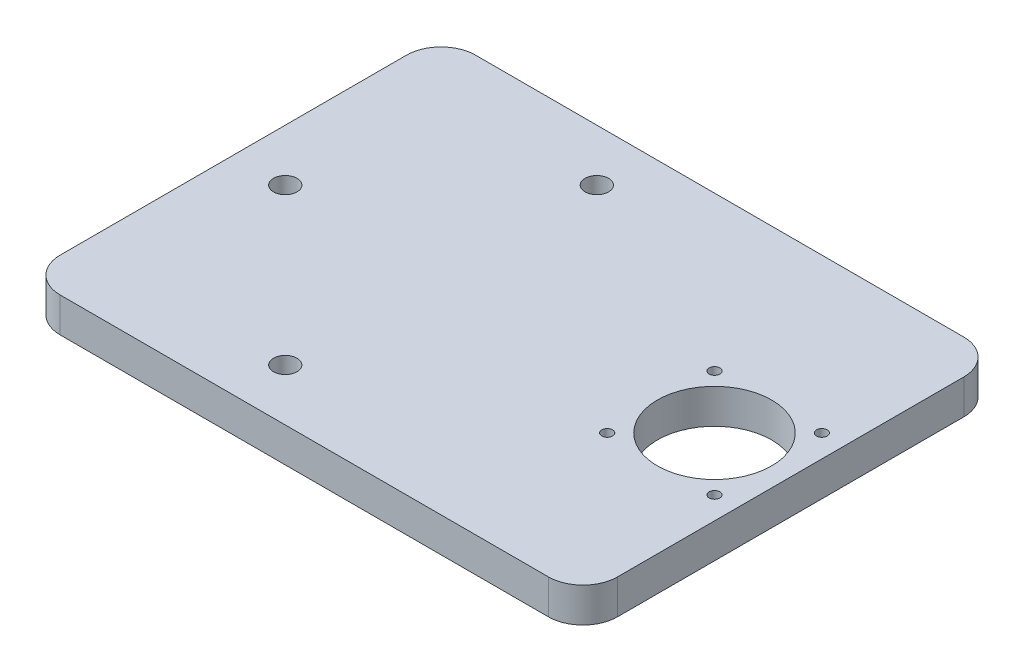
ISO-10303-21;
HEADER;
FILE_DESCRIPTION(('STEP AP214'),'2;1');
FILE_NAME('part.step','',(''),(''),'','','');
FILE_SCHEMA(('AUTOMOTIVE_DESIGN { 1 0 10303 214 1 1 1 1 }'));
ENDSEC;
DATA;
#1=APPLICATION_CONTEXT('core data for automotive mechanical design processes');
#2=APPLICATION_PROTOCOL_DEFINITION('international standard','automotive_design',2000,#1);
#3=PRODUCT_CONTEXT('',#1,'mechanical');
#4=PRODUCT('Part','Part','',(#3));
#5=PRODUCT_RELATED_PRODUCT_CATEGORY('part','',(#4));
#6=PRODUCT_DEFINITION_FORMATION('','',#4);
#7=PRODUCT_DEFINITION_CONTEXT('part definition',#1,'design');
#8=PRODUCT_DEFINITION('design','',#6,#7);
#9=PRODUCT_DEFINITION_SHAPE('','',#8);
#10=(LENGTH_UNIT() NAMED_UNIT(*) SI_UNIT(.MILLI.,.METRE.));
#11=(NAMED_UNIT(*) PLANE_ANGLE_UNIT() SI_UNIT($,.RADIAN.));
#12=(NAMED_UNIT(*) SI_UNIT($,.STERADIAN.) SOLID_ANGLE_UNIT());
#13=UNCERTAINTY_MEASURE_WITH_UNIT(LENGTH_MEASURE(1.E-05),#10,'distance_accuracy_value','');
#14=(GEOMETRIC_REPRESENTATION_CONTEXT(3) GLOBAL_UNCERTAINTY_ASSIGNED_CONTEXT((#13)) GLOBAL_UNIT_ASSIGNED_CONTEXT((#10,
#11,#12)) REPRESENTATION_CONTEXT('',''));
#15=CARTESIAN_POINT('',(0.,0.,0.));
#16=DIRECTION('',(0.,0.,1.));
#17=DIRECTION('',(1.,0.,0.));
#18=AXIS2_PLACEMENT_3D('',#15,#16,#17);
#19=CARTESIAN_POINT('',(80.5,10.,60.));
#20=DIRECTION('',(-1.,0.,0.));
#21=DIRECTION('',(0.,0.,1.));
#22=AXIS2_PLACEMENT_3D('',#19,#20,#21);
#23=PLANE('',#22);
#24=DIRECTION('',(0.,0.,-1.));
#25=VECTOR('',#24,1.);
#26=CARTESIAN_POINT('',(80.5,10.,60.));
#27=LINE('',#26,#25);
#28=CARTESIAN_POINT('',(80.5,10.,50.));
#29=VERTEX_POINT('',#28);
#30=CARTESIAN_POINT('',(80.5,10.,-50.));
#31=VERTEX_POINT('',#30);
#32=EDGE_CURVE('E130',#29,#31,#27,.T.);
#33=ORIENTED_EDGE('',*,*,#32,.F.);
#34=DIRECTION('',(0.,-1.,0.));
#35=VECTOR('',#34,1.);
#36=CARTESIAN_POINT('',(80.5,10.,50.));
#37=LINE('',#36,#35);
#38=CARTESIAN_POINT('',(80.5,0.,50.));
#39=VERTEX_POINT('',#38);
#40=EDGE_CURVE('E113',#29,#39,#37,.T.);
#41=ORIENTED_EDGE('',*,*,#40,.T.);
#42=DIRECTION('',(0.,0.,-1.));
#43=VECTOR('',#42,1.);
#44=CARTESIAN_POINT('',(80.5,0.,60.));
#45=LINE('',#44,#43);
#46=CARTESIAN_POINT('',(80.5,0.,-50.));
#47=VERTEX_POINT('',#46);
#48=EDGE_CURVE('E123',#39,#47,#45,.T.);
#49=ORIENTED_EDGE('',*,*,#48,.T.);
#50=DIRECTION('',(0.,-1.,0.));
#51=VECTOR('',#50,1.);
#52=CARTESIAN_POINT('',(80.5,10.,-50.));
#53=LINE('',#52,#51);
#54=EDGE_CURVE('E127',#47,#31,#53,.F.);
#55=ORIENTED_EDGE('',*,*,#54,.T.);
#56=EDGE_LOOP('',(#33,#41,#49,#55));
#57=FACE_BOUND('',#56,.T.);
#58=ADVANCED_FACE('F43',(#57),#23,.F.);
#59=CARTESIAN_POINT('',(-80.5,10.,-60.));
#60=DIRECTION('',(0.,0.,1.));
#61=DIRECTION('',(1.,0.,0.));
#62=AXIS2_PLACEMENT_3D('',#59,#60,#61);
#63=PLANE('',#62);
#64=DIRECTION('',(-1.,0.,0.));
#65=VECTOR('',#64,1.);
#66=CARTESIAN_POINT('',(-80.5,10.,-60.));
#67=LINE('',#66,#65);
#68=CARTESIAN_POINT('',(70.5,10.,-60.));
#69=VERTEX_POINT('',#68);
#70=CARTESIAN_POINT('',(-70.5,10.,-60.));
#71=VERTEX_POINT('',#70);
#72=EDGE_CURVE('E172',#69,#71,#67,.T.);
#73=ORIENTED_EDGE('',*,*,#72,.F.);
#74=DIRECTION('',(0.,-1.,0.));
#75=VECTOR('',#74,1.);
#76=CARTESIAN_POINT('',(70.5,10.,-60.));
#77=LINE('',#76,#75);
#78=CARTESIAN_POINT('',(70.5,0.,-60.));
#79=VERTEX_POINT('',#78);
#80=EDGE_CURVE('E170',#69,#79,#77,.T.);
#81=ORIENTED_EDGE('',*,*,#80,.T.);
#82=DIRECTION('',(-1.,0.,0.));
#83=VECTOR('',#82,1.);
#84=CARTESIAN_POINT('',(-80.5,0.,-60.));
#85=LINE('',#84,#83);
#86=CARTESIAN_POINT('',(-70.5,0.,-60.));
#87=VERTEX_POINT('',#86);
#88=EDGE_CURVE('E131',#79,#87,#85,.T.);
#89=ORIENTED_EDGE('',*,*,#88,.T.);
#90=DIRECTION('',(0.,-1.,0.));
#91=VECTOR('',#90,1.);
#92=CARTESIAN_POINT('',(-70.5,10.,-60.));
#93=LINE('',#92,#91);
#94=EDGE_CURVE('E164',#87,#71,#93,.F.);
#95=ORIENTED_EDGE('',*,*,#94,.T.);
#96=EDGE_LOOP('',(#73,#81,#89,#95));
#97=FACE_BOUND('',#96,.T.);
#98=ADVANCED_FACE('F175',(#97),#63,.F.);
#99=CARTESIAN_POINT('',(-80.5,10.,60.));
#100=DIRECTION('',(1.,0.,0.));
#101=DIRECTION('',(0.,0.,-1.));
#102=AXIS2_PLACEMENT_3D('',#99,#100,#101);
#103=PLANE('',#102);
#104=DIRECTION('',(0.,0.,1.));
#105=VECTOR('',#104,1.);
#106=CARTESIAN_POINT('',(-80.5,10.,60.));
#107=LINE('',#106,#105);
#108=CARTESIAN_POINT('',(-80.5,10.,-50.));
#109=VERTEX_POINT('',#108);
#110=CARTESIAN_POINT('',(-80.5,10.,50.));
#111=VERTEX_POINT('',#110);
#112=EDGE_CURVE('E185',#109,#111,#107,.T.);
#113=ORIENTED_EDGE('',*,*,#112,.F.);
#114=DIRECTION('',(0.,-1.,0.));
#115=VECTOR('',#114,1.);
#116=CARTESIAN_POINT('',(-80.5,10.,-50.));
#117=LINE('',#116,#115);
#118=CARTESIAN_POINT('',(-80.5,0.,-50.));
#119=VERTEX_POINT('',#118);
#120=EDGE_CURVE('E11',#109,#119,#117,.T.);
#121=ORIENTED_EDGE('',*,*,#120,.T.);
#122=DIRECTION('',(0.,0.,1.));
#123=VECTOR('',#122,1.);
#124=CARTESIAN_POINT('',(-80.5,0.,60.));
#125=LINE('',#124,#123);
#126=CARTESIAN_POINT('',(-80.5,0.,50.));
#127=VERTEX_POINT('',#126);
#128=EDGE_CURVE('E137',#119,#127,#125,.T.);
#129=ORIENTED_EDGE('',*,*,#128,.T.);
#130=DIRECTION('',(0.,-1.,0.));
#131=VECTOR('',#130,1.);
#132=CARTESIAN_POINT('',(-80.5,10.,50.));
#133=LINE('',#132,#131);
#134=EDGE_CURVE('E51',#127,#111,#133,.F.);
#135=ORIENTED_EDGE('',*,*,#134,.T.);
#136=EDGE_LOOP('',(#113,#121,#129,#135));
#137=FACE_BOUND('',#136,.T.);
#138=ADVANCED_FACE('F181',(#137),#103,.F.);
#139=CARTESIAN_POINT('',(-80.5,10.,60.));
#140=DIRECTION('',(0.,0.,-1.));
#141=DIRECTION('',(-1.,0.,0.));
#142=AXIS2_PLACEMENT_3D('',#139,#140,#141);
#143=PLANE('',#142);
#144=DIRECTION('',(1.,0.,0.));
#145=VECTOR('',#144,1.);
#146=CARTESIAN_POINT('',(-80.5,0.,60.));
#147=LINE('',#146,#145);
#148=CARTESIAN_POINT('',(-70.5,0.,60.));
#149=VERTEX_POINT('',#148);
#150=CARTESIAN_POINT('',(70.5,0.,60.));
#151=VERTEX_POINT('',#150);
#152=EDGE_CURVE('E150',#149,#151,#147,.T.);
#153=ORIENTED_EDGE('',*,*,#152,.T.);
#154=DIRECTION('',(0.,-1.,0.));
#155=VECTOR('',#154,1.);
#156=CARTESIAN_POINT('',(70.5,10.,60.));
#157=LINE('',#156,#155);
#158=CARTESIAN_POINT('',(70.5,10.,60.));
#159=VERTEX_POINT('',#158);
#160=EDGE_CURVE('E112',#151,#159,#157,.F.);
#161=ORIENTED_EDGE('',*,*,#160,.T.);
#162=DIRECTION('',(1.,0.,0.));
#163=VECTOR('',#162,1.);
#164=CARTESIAN_POINT('',(-80.5,10.,60.));
#165=LINE('',#164,#163);
#166=CARTESIAN_POINT('',(-70.5,10.,60.));
#167=VERTEX_POINT('',#166);
#168=EDGE_CURVE('E144',#167,#159,#165,.T.);
#169=ORIENTED_EDGE('',*,*,#168,.F.);
#170=DIRECTION('',(0.,-1.,0.));
#171=VECTOR('',#170,1.);
#172=CARTESIAN_POINT('',(-70.5,10.,60.));
#173=LINE('',#172,#171);
#174=EDGE_CURVE('E118',#167,#149,#173,.T.);
#175=ORIENTED_EDGE('',*,*,#174,.T.);
#176=EDGE_LOOP('',(#153,#161,#169,#175));
#177=FACE_BOUND('',#176,.T.);
#178=ADVANCED_FACE('F267',(#177),#143,.F.);
#179=CARTESIAN_POINT('',(0.,10.,0.));
#180=DIRECTION('',(0.,-1.,0.));
#181=DIRECTION('',(0.,0.,-1.));
#182=AXIS2_PLACEMENT_3D('',#179,#180,#181);
#183=PLANE('',#182);
#184=CARTESIAN_POINT('',(-20.4999999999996,10.,45.));
#185=DIRECTION('',(0.,-1.,0.));
#186=DIRECTION('',(0.,0.,-1.));
#187=AXIS2_PLACEMENT_3D('',#184,#185,#186);
#188=CIRCLE('',#187,3.4);
#189=CARTESIAN_POINT('',(-20.4999999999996,10.,41.6));
#190=VERTEX_POINT('',#189);
#191=EDGE_CURVE('E211',#190,#190,#188,.T.);
#192=ORIENTED_EDGE('',*,*,#191,.T.);
#193=EDGE_LOOP('',(#192));
#194=FACE_BOUND('',#193,.T.);
#195=CARTESIAN_POINT('',(-65.5,10.,3.51845289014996E-12));
#196=DIRECTION('',(0.,-1.,0.));
#197=DIRECTION('',(0.,0.,-1.));
#198=AXIS2_PLACEMENT_3D('',#195,#196,#197);
#199=CIRCLE('',#198,3.4);
#200=CARTESIAN_POINT('',(-65.5,10.,-3.39999999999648));
#201=VERTEX_POINT('',#200);
#202=EDGE_CURVE('E221',#201,#201,#199,.T.);
#203=ORIENTED_EDGE('',*,*,#202,.T.);
#204=EDGE_LOOP('',(#203));
#205=FACE_BOUND('',#204,.T.);
#206=CARTESIAN_POINT('',(-20.4999999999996,10.,-45.));
#207=DIRECTION('',(0.,-1.,0.));
#208=DIRECTION('',(0.,0.,-1.));
#209=AXIS2_PLACEMENT_3D('',#206,#207,#208);
#210=CIRCLE('',#209,3.4);
#211=CARTESIAN_POINT('',(-20.4999999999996,10.,-48.4));
#212=VERTEX_POINT('',#211);
#213=EDGE_CURVE('E212',#212,#212,#210,.T.);
#214=ORIENTED_EDGE('',*,*,#213,.T.);
#215=EDGE_LOOP('',(#214));
#216=FACE_BOUND('',#215,.T.);
#217=CARTESIAN_POINT('',(58.5000000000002,10.,2.72676846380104E-12));
#218=DIRECTION('',(0.,-1.,0.));
#219=DIRECTION('',(0.,0.,-1.));
#220=AXIS2_PLACEMENT_3D('',#217,#218,#219);
#221=CIRCLE('',#220,16.5);
#222=CARTESIAN_POINT('',(58.5000000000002,10.,-16.4999999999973));
#223=VERTEX_POINT('',#222);
#224=EDGE_CURVE('E207',#223,#223,#221,.T.);
#225=ORIENTED_EDGE('',*,*,#224,.T.);
#226=EDGE_LOOP('',(#225));
#227=FACE_BOUND('',#226,.T.);
#228=CARTESIAN_POINT('',(74.0000000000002,10.,15.5000000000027));
#229=DIRECTION('',(0.,1.,0.));
#230=DIRECTION('',(0.,0.,1.));
#231=AXIS2_PLACEMENT_3D('',#228,#229,#230);
#232=CIRCLE('',#231,1.54999999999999);
#233=CARTESIAN_POINT('',(74.0000000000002,10.,17.0500000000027));
#234=VERTEX_POINT('',#233);
#235=EDGE_CURVE('E186',#234,#234,#232,.T.);
#236=ORIENTED_EDGE('',*,*,#235,.F.);
#237=EDGE_LOOP('',(#236));
#238=FACE_BOUND('',#237,.T.);
#239=CARTESIAN_POINT('',(43.0000000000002,10.,-15.4999999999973));
#240=DIRECTION('',(0.,1.,0.));
#241=DIRECTION('',(0.,0.,1.));
#242=AXIS2_PLACEMENT_3D('',#239,#240,#241);
#243=CIRCLE('',#242,1.55);
#244=CARTESIAN_POINT('',(43.0000000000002,10.,-13.9499999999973));
#245=VERTEX_POINT('',#244);
#246=EDGE_CURVE('E193',#245,#245,#243,.T.);
#247=ORIENTED_EDGE('',*,*,#246,.F.);
#248=EDGE_LOOP('',(#247));
#249=FACE_BOUND('',#248,.T.);
#250=CARTESIAN_POINT('',(43.0000000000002,10.,15.5000000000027));
#251=DIRECTION('',(0.,1.,0.));
#252=DIRECTION('',(0.,0.,1.));
#253=AXIS2_PLACEMENT_3D('',#250,#251,#252);
#254=CIRCLE('',#253,1.55);
#255=CARTESIAN_POINT('',(43.0000000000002,10.,17.0500000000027));
#256=VERTEX_POINT('',#255);
#257=EDGE_CURVE('E192',#256,#256,#254,.T.);
#258=ORIENTED_EDGE('',*,*,#257,.F.);
#259=EDGE_LOOP('',(#258));
#260=FACE_BOUND('',#259,.T.);
#261=CARTESIAN_POINT('',(74.0000000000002,10.,-15.4999999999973));
#262=DIRECTION('',(0.,1.,0.));
#263=DIRECTION('',(0.,0.,1.));
#264=AXIS2_PLACEMENT_3D('',#261,#262,#263);
#265=CIRCLE('',#264,1.54999999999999);
#266=CARTESIAN_POINT('',(74.0000000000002,10.,-13.9499999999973));
#267=VERTEX_POINT('',#266);
#268=EDGE_CURVE('E142',#267,#267,#265,.T.);
#269=ORIENTED_EDGE('',*,*,#268,.F.);
#270=EDGE_LOOP('',(#269));
#271=FACE_BOUND('',#270,.T.);
#272=ORIENTED_EDGE('',*,*,#168,.T.);
#273=CARTESIAN_POINT('',(70.5,10.,50.));
#274=DIRECTION('',(0.,-1.,0.));
#275=DIRECTION('',(0.,0.,-1.));
#276=AXIS2_PLACEMENT_3D('',#273,#274,#275);
#277=CIRCLE('',#276,10.);
#278=EDGE_CURVE('E161',#159,#29,#277,.F.);
#279=ORIENTED_EDGE('',*,*,#278,.T.);
#280=ORIENTED_EDGE('',*,*,#32,.T.);
#281=CARTESIAN_POINT('',(70.5,10.,-50.));
#282=DIRECTION('',(0.,-1.,0.));
#283=DIRECTION('',(0.,0.,-1.));
#284=AXIS2_PLACEMENT_3D('',#281,#282,#283);
#285=CIRCLE('',#284,10.);
#286=EDGE_CURVE('E163',#31,#69,#285,.F.);
#287=ORIENTED_EDGE('',*,*,#286,.T.);
#288=ORIENTED_EDGE('',*,*,#72,.T.);
#289=CARTESIAN_POINT('',(-70.5,10.,-50.));
#290=DIRECTION('',(0.,-1.,0.));
#291=DIRECTION('',(0.,0.,-1.));
#292=AXIS2_PLACEMENT_3D('',#289,#290,#291);
#293=CIRCLE('',#292,10.);
#294=EDGE_CURVE('E63',#71,#109,#293,.F.);
#295=ORIENTED_EDGE('',*,*,#294,.T.);
#296=ORIENTED_EDGE('',*,*,#112,.T.);
#297=CARTESIAN_POINT('',(-70.5,10.,50.));
#298=DIRECTION('',(0.,-1.,0.));
#299=DIRECTION('',(0.,0.,-1.));
#300=AXIS2_PLACEMENT_3D('',#297,#298,#299);
#301=CIRCLE('',#300,10.);
#302=EDGE_CURVE('E157',#111,#167,#301,.F.);
#303=ORIENTED_EDGE('',*,*,#302,.T.);
#304=EDGE_LOOP('',(#272,#279,#280,#287,#288,#295,#296,#303));
#305=FACE_BOUND('',#304,.T.);
#306=ADVANCED_FACE('F231',(#194,#205,#216,#227,#238,#249,#260,#271,#305),#183,.F.);
#307=CARTESIAN_POINT('',(0.,0.,0.));
#308=DIRECTION('',(0.,-1.,0.));
#309=DIRECTION('',(0.,0.,-1.));
#310=AXIS2_PLACEMENT_3D('',#307,#308,#309);
#311=PLANE('',#310);
#312=CARTESIAN_POINT('',(-20.4999999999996,0.,45.));
#313=DIRECTION('',(0.,-1.,0.));
#314=DIRECTION('',(0.,0.,-1.));
#315=AXIS2_PLACEMENT_3D('',#312,#313,#314);
#316=CIRCLE('',#315,3.4);
#317=CARTESIAN_POINT('',(-20.4999999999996,0.,41.6));
#318=VERTEX_POINT('',#317);
#319=EDGE_CURVE('E227',#318,#318,#316,.T.);
#320=ORIENTED_EDGE('',*,*,#319,.F.);
#321=EDGE_LOOP('',(#320));
#322=FACE_BOUND('',#321,.T.);
#323=CARTESIAN_POINT('',(-65.5,0.,3.51845289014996E-12));
#324=DIRECTION('',(0.,-1.,0.));
#325=DIRECTION('',(0.,0.,-1.));
#326=AXIS2_PLACEMENT_3D('',#323,#324,#325);
#327=CIRCLE('',#326,3.4);
#328=CARTESIAN_POINT('',(-65.5,0.,-3.39999999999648));
#329=VERTEX_POINT('',#328);
#330=EDGE_CURVE('E223',#329,#329,#327,.T.);
#331=ORIENTED_EDGE('',*,*,#330,.F.);
#332=EDGE_LOOP('',(#331));
#333=FACE_BOUND('',#332,.T.);
#334=CARTESIAN_POINT('',(-20.4999999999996,0.,-45.));
#335=DIRECTION('',(0.,-1.,0.));
#336=DIRECTION('',(0.,0.,-1.));
#337=AXIS2_PLACEMENT_3D('',#334,#335,#336);
#338=CIRCLE('',#337,3.4);
#339=CARTESIAN_POINT('',(-20.4999999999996,0.,-48.4));
#340=VERTEX_POINT('',#339);
#341=EDGE_CURVE('E220',#340,#340,#338,.T.);
#342=ORIENTED_EDGE('',*,*,#341,.F.);
#343=EDGE_LOOP('',(#342));
#344=FACE_BOUND('',#343,.T.);
#345=CARTESIAN_POINT('',(58.5000000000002,0.,2.72676846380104E-12));
#346=DIRECTION('',(0.,-1.,0.));
#347=DIRECTION('',(0.,0.,-1.));
#348=AXIS2_PLACEMENT_3D('',#345,#346,#347);
#349=CIRCLE('',#348,16.5);
#350=CARTESIAN_POINT('',(58.5000000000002,0.,-16.4999999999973));
#351=VERTEX_POINT('',#350);
#352=EDGE_CURVE('E209',#351,#351,#349,.T.);
#353=ORIENTED_EDGE('',*,*,#352,.F.);
#354=EDGE_LOOP('',(#353));
#355=FACE_BOUND('',#354,.T.);
#356=CARTESIAN_POINT('',(74.0000000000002,0.,15.5000000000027));
#357=DIRECTION('',(0.,1.,0.));
#358=DIRECTION('',(0.,0.,1.));
#359=AXIS2_PLACEMENT_3D('',#356,#357,#358);
#360=CIRCLE('',#359,1.54999999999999);
#361=CARTESIAN_POINT('',(74.0000000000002,0.,17.0500000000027));
#362=VERTEX_POINT('',#361);
#363=EDGE_CURVE('E200',#362,#362,#360,.T.);
#364=ORIENTED_EDGE('',*,*,#363,.T.);
#365=EDGE_LOOP('',(#364));
#366=FACE_BOUND('',#365,.T.);
#367=CARTESIAN_POINT('',(43.0000000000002,0.,-15.4999999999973));
#368=DIRECTION('',(0.,1.,0.));
#369=DIRECTION('',(0.,0.,1.));
#370=AXIS2_PLACEMENT_3D('',#367,#368,#369);
#371=CIRCLE('',#370,1.55);
#372=CARTESIAN_POINT('',(43.0000000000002,0.,-13.9499999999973));
#373=VERTEX_POINT('',#372);
#374=EDGE_CURVE('E194',#373,#373,#371,.T.);
#375=ORIENTED_EDGE('',*,*,#374,.T.);
#376=EDGE_LOOP('',(#375));
#377=FACE_BOUND('',#376,.T.);
#378=CARTESIAN_POINT('',(43.0000000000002,0.,15.5000000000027));
#379=DIRECTION('',(0.,1.,0.));
#380=DIRECTION('',(0.,0.,1.));
#381=AXIS2_PLACEMENT_3D('',#378,#379,#380);
#382=CIRCLE('',#381,1.55);
#383=CARTESIAN_POINT('',(43.0000000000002,0.,17.0500000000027));
#384=VERTEX_POINT('',#383);
#385=EDGE_CURVE('E202',#384,#384,#382,.T.);
#386=ORIENTED_EDGE('',*,*,#385,.T.);
#387=EDGE_LOOP('',(#386));
#388=FACE_BOUND('',#387,.T.);
#389=CARTESIAN_POINT('',(74.0000000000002,0.,-15.4999999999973));
#390=DIRECTION('',(0.,1.,0.));
#391=DIRECTION('',(0.,0.,1.));
#392=AXIS2_PLACEMENT_3D('',#389,#390,#391);
#393=CIRCLE('',#392,1.54999999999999);
#394=CARTESIAN_POINT('',(74.0000000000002,0.,-13.9499999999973));
#395=VERTEX_POINT('',#394);
#396=EDGE_CURVE('E133',#395,#395,#393,.T.);
#397=ORIENTED_EDGE('',*,*,#396,.T.);
#398=EDGE_LOOP('',(#397));
#399=FACE_BOUND('',#398,.T.);
#400=ORIENTED_EDGE('',*,*,#48,.F.);
#401=CARTESIAN_POINT('',(70.5,0.,50.));
#402=DIRECTION('',(0.,-1.,0.));
#403=DIRECTION('',(0.,0.,-1.));
#404=AXIS2_PLACEMENT_3D('',#401,#402,#403);
#405=CIRCLE('',#404,10.);
#406=EDGE_CURVE('E107',#39,#151,#405,.T.);
#407=ORIENTED_EDGE('',*,*,#406,.T.);
#408=ORIENTED_EDGE('',*,*,#152,.F.);
#409=CARTESIAN_POINT('',(-70.5,0.,50.));
#410=DIRECTION('',(0.,-1.,0.));
#411=DIRECTION('',(0.,0.,-1.));
#412=AXIS2_PLACEMENT_3D('',#409,#410,#411);
#413=CIRCLE('',#412,10.);
#414=EDGE_CURVE('E128',#149,#127,#413,.T.);
#415=ORIENTED_EDGE('',*,*,#414,.T.);
#416=ORIENTED_EDGE('',*,*,#128,.F.);
#417=CARTESIAN_POINT('',(-70.5,0.,-50.));
#418=DIRECTION('',(0.,-1.,0.));
#419=DIRECTION('',(0.,0.,-1.));
#420=AXIS2_PLACEMENT_3D('',#417,#418,#419);
#421=CIRCLE('',#420,10.);
#422=EDGE_CURVE('E154',#119,#87,#421,.T.);
#423=ORIENTED_EDGE('',*,*,#422,.T.);
#424=ORIENTED_EDGE('',*,*,#88,.F.);
#425=CARTESIAN_POINT('',(70.5,0.,-50.));
#426=DIRECTION('',(0.,-1.,0.));
#427=DIRECTION('',(0.,0.,-1.));
#428=AXIS2_PLACEMENT_3D('',#425,#426,#427);
#429=CIRCLE('',#428,10.);
#430=EDGE_CURVE('E119',#79,#47,#429,.T.);
#431=ORIENTED_EDGE('',*,*,#430,.T.);
#432=EDGE_LOOP('',(#400,#407,#408,#415,#416,#423,#424,#431));
#433=FACE_BOUND('',#432,.T.);
#434=ADVANCED_FACE('F134',(#322,#333,#344,#355,#366,#377,#388,#399,#433),#311,.T.);
#435=CARTESIAN_POINT('',(70.5,10.,50.));
#436=DIRECTION('',(0.,-1.,0.));
#437=DIRECTION('',(0.,0.,-1.));
#438=AXIS2_PLACEMENT_3D('',#435,#436,#437);
#439=CYLINDRICAL_SURFACE('',#438,10.);
#440=ORIENTED_EDGE('',*,*,#278,.F.);
#441=ORIENTED_EDGE('',*,*,#160,.F.);
#442=ORIENTED_EDGE('',*,*,#406,.F.);
#443=ORIENTED_EDGE('',*,*,#40,.F.);
#444=EDGE_LOOP('',(#440,#441,#442,#443));
#445=FACE_BOUND('',#444,.T.);
#446=ADVANCED_FACE('F115',(#445),#439,.T.);
#447=CARTESIAN_POINT('',(70.5,10.,-50.));
#448=DIRECTION('',(0.,-1.,0.));
#449=DIRECTION('',(0.,0.,-1.));
#450=AXIS2_PLACEMENT_3D('',#447,#448,#449);
#451=CYLINDRICAL_SURFACE('',#450,10.);
#452=ORIENTED_EDGE('',*,*,#286,.F.);
#453=ORIENTED_EDGE('',*,*,#54,.F.);
#454=ORIENTED_EDGE('',*,*,#430,.F.);
#455=ORIENTED_EDGE('',*,*,#80,.F.);
#456=EDGE_LOOP('',(#452,#453,#454,#455));
#457=FACE_BOUND('',#456,.T.);
#458=ADVANCED_FACE('F280',(#457),#451,.T.);
#459=CARTESIAN_POINT('',(-70.5,10.,-50.));
#460=DIRECTION('',(0.,-1.,0.));
#461=DIRECTION('',(0.,0.,-1.));
#462=AXIS2_PLACEMENT_3D('',#459,#460,#461);
#463=CYLINDRICAL_SURFACE('',#462,10.);
#464=ORIENTED_EDGE('',*,*,#294,.F.);
#465=ORIENTED_EDGE('',*,*,#94,.F.);
#466=ORIENTED_EDGE('',*,*,#422,.F.);
#467=ORIENTED_EDGE('',*,*,#120,.F.);
#468=EDGE_LOOP('',(#464,#465,#466,#467));
#469=FACE_BOUND('',#468,.T.);
#470=ADVANCED_FACE('F179',(#469),#463,.T.);
#471=CARTESIAN_POINT('',(-70.5,10.,50.));
#472=DIRECTION('',(0.,-1.,0.));
#473=DIRECTION('',(0.,0.,-1.));
#474=AXIS2_PLACEMENT_3D('',#471,#472,#473);
#475=CYLINDRICAL_SURFACE('',#474,10.);
#476=ORIENTED_EDGE('',*,*,#302,.F.);
#477=ORIENTED_EDGE('',*,*,#134,.F.);
#478=ORIENTED_EDGE('',*,*,#414,.F.);
#479=ORIENTED_EDGE('',*,*,#174,.F.);
#480=EDGE_LOOP('',(#476,#477,#478,#479));
#481=FACE_BOUND('',#480,.T.);
#482=ADVANCED_FACE('F44',(#481),#475,.T.);
#483=CARTESIAN_POINT('',(74.0000000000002,0.,-15.4999999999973));
#484=DIRECTION('',(0.,1.,0.));
#485=DIRECTION('',(0.,0.,1.));
#486=AXIS2_PLACEMENT_3D('',#483,#484,#485);
#487=CYLINDRICAL_SURFACE('',#486,1.54999999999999);
#488=ORIENTED_EDGE('',*,*,#396,.F.);
#489=EDGE_LOOP('',(#488));
#490=FACE_BOUND('',#489,.T.);
#491=ORIENTED_EDGE('',*,*,#268,.T.);
#492=EDGE_LOOP('',(#491));
#493=FACE_BOUND('',#492,.T.);
#494=ADVANCED_FACE('F257',(#490,#493),#487,.F.);
#495=CARTESIAN_POINT('',(43.0000000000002,0.,15.5000000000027));
#496=DIRECTION('',(0.,1.,0.));
#497=DIRECTION('',(0.,0.,1.));
#498=AXIS2_PLACEMENT_3D('',#495,#496,#497);
#499=CYLINDRICAL_SURFACE('',#498,1.55);
#500=ORIENTED_EDGE('',*,*,#385,.F.);
#501=EDGE_LOOP('',(#500));
#502=FACE_BOUND('',#501,.T.);
#503=ORIENTED_EDGE('',*,*,#257,.T.);
#504=EDGE_LOOP('',(#503));
#505=FACE_BOUND('',#504,.T.);
#506=ADVANCED_FACE('F265',(#502,#505),#499,.F.);
#507=CARTESIAN_POINT('',(43.0000000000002,0.,-15.4999999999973));
#508=DIRECTION('',(0.,1.,0.));
#509=DIRECTION('',(0.,0.,1.));
#510=AXIS2_PLACEMENT_3D('',#507,#508,#509);
#511=CYLINDRICAL_SURFACE('',#510,1.55);
#512=ORIENTED_EDGE('',*,*,#374,.F.);
#513=EDGE_LOOP('',(#512));
#514=FACE_BOUND('',#513,.T.);
#515=ORIENTED_EDGE('',*,*,#246,.T.);
#516=EDGE_LOOP('',(#515));
#517=FACE_BOUND('',#516,.T.);
#518=ADVANCED_FACE('F318',(#514,#517),#511,.F.);
#519=CARTESIAN_POINT('',(74.0000000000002,0.,15.5000000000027));
#520=DIRECTION('',(0.,1.,0.));
#521=DIRECTION('',(0.,0.,1.));
#522=AXIS2_PLACEMENT_3D('',#519,#520,#521);
#523=CYLINDRICAL_SURFACE('',#522,1.54999999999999);
#524=ORIENTED_EDGE('',*,*,#363,.F.);
#525=EDGE_LOOP('',(#524));
#526=FACE_BOUND('',#525,.T.);
#527=ORIENTED_EDGE('',*,*,#235,.T.);
#528=EDGE_LOOP('',(#527));
#529=FACE_BOUND('',#528,.T.);
#530=ADVANCED_FACE('F328',(#526,#529),#523,.F.);
#531=CARTESIAN_POINT('',(58.5000000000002,10.,2.72676846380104E-12));
#532=DIRECTION('',(0.,-1.,0.));
#533=DIRECTION('',(0.,0.,-1.));
#534=AXIS2_PLACEMENT_3D('',#531,#532,#533);
#535=CYLINDRICAL_SURFACE('',#534,16.5);
#536=ORIENTED_EDGE('',*,*,#224,.F.);
#537=EDGE_LOOP('',(#536));
#538=FACE_BOUND('',#537,.T.);
#539=ORIENTED_EDGE('',*,*,#352,.T.);
#540=EDGE_LOOP('',(#539));
#541=FACE_BOUND('',#540,.T.);
#542=ADVANCED_FACE('F338',(#538,#541),#535,.F.);
#543=CARTESIAN_POINT('',(-20.4999999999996,10.,-45.));
#544=DIRECTION('',(0.,-1.,0.));
#545=DIRECTION('',(0.,0.,-1.));
#546=AXIS2_PLACEMENT_3D('',#543,#544,#545);
#547=CYLINDRICAL_SURFACE('',#546,3.4);
#548=ORIENTED_EDGE('',*,*,#213,.F.);
#549=EDGE_LOOP('',(#548));
#550=FACE_BOUND('',#549,.T.);
#551=ORIENTED_EDGE('',*,*,#341,.T.);
#552=EDGE_LOOP('',(#551));
#553=FACE_BOUND('',#552,.T.);
#554=ADVANCED_FACE('F351',(#550,#553),#547,.F.);
#555=CARTESIAN_POINT('',(-65.5,10.,3.51845289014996E-12));
#556=DIRECTION('',(0.,-1.,0.));
#557=DIRECTION('',(0.,0.,-1.));
#558=AXIS2_PLACEMENT_3D('',#555,#556,#557);
#559=CYLINDRICAL_SURFACE('',#558,3.4);
#560=ORIENTED_EDGE('',*,*,#202,.F.);
#561=EDGE_LOOP('',(#560));
#562=FACE_BOUND('',#561,.T.);
#563=ORIENTED_EDGE('',*,*,#330,.T.);
#564=EDGE_LOOP('',(#563));
#565=FACE_BOUND('',#564,.T.);
#566=ADVANCED_FACE('F237',(#562,#565),#559,.F.);
#567=CARTESIAN_POINT('',(-20.4999999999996,10.,45.));
#568=DIRECTION('',(0.,-1.,0.));
#569=DIRECTION('',(0.,0.,-1.));
#570=AXIS2_PLACEMENT_3D('',#567,#568,#569);
#571=CYLINDRICAL_SURFACE('',#570,3.4);
#572=ORIENTED_EDGE('',*,*,#191,.F.);
#573=EDGE_LOOP('',(#572));
#574=FACE_BOUND('',#573,.T.);
#575=ORIENTED_EDGE('',*,*,#319,.T.);
#576=EDGE_LOOP('',(#575));
#577=FACE_BOUND('',#576,.T.);
#578=ADVANCED_FACE('F236',(#574,#577),#571,.F.);
#579=CLOSED_SHELL('',(#58,#98,#138,#178,#306,#434,#446,#458,#470,#482,#494,#506,#518,#530,#542,
#554,#566,#578));
#580=MANIFOLD_SOLID_BREP('B2',#579);
#581=ADVANCED_BREP_SHAPE_REPRESENTATION('',(#18,#580),#14);
#582=SHAPE_DEFINITION_REPRESENTATION(#9,#581);
ENDSEC;
END-ISO-10303-21;
